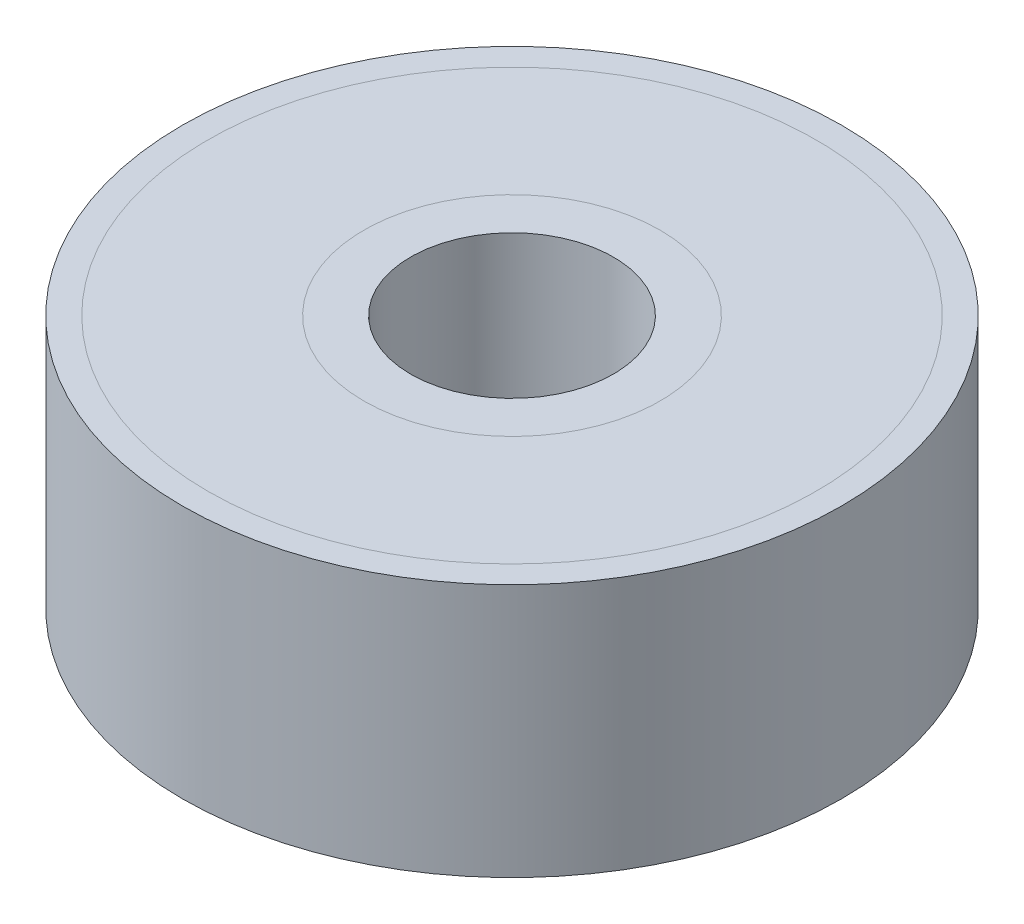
ISO-10303-21;
HEADER;
FILE_DESCRIPTION(('STEP AP214'),'2;1');
FILE_NAME('part.step','',(''),(''),'','','');
FILE_SCHEMA(('AUTOMOTIVE_DESIGN { 1 0 10303 214 1 1 1 1 }'));
ENDSEC;
DATA;
#1=APPLICATION_CONTEXT('core data for automotive mechanical design processes');
#2=APPLICATION_PROTOCOL_DEFINITION('international standard','automotive_design',2000,#1);
#3=PRODUCT_CONTEXT('',#1,'mechanical');
#4=PRODUCT('Part','Part','',(#3));
#5=PRODUCT_RELATED_PRODUCT_CATEGORY('part','',(#4));
#6=PRODUCT_DEFINITION_FORMATION('','',#4);
#7=PRODUCT_DEFINITION_CONTEXT('part definition',#1,'design');
#8=PRODUCT_DEFINITION('design','',#6,#7);
#9=PRODUCT_DEFINITION_SHAPE('','',#8);
#10=(LENGTH_UNIT() NAMED_UNIT(*) SI_UNIT(.MILLI.,.METRE.));
#11=(NAMED_UNIT(*) PLANE_ANGLE_UNIT() SI_UNIT($,.RADIAN.));
#12=(NAMED_UNIT(*) SI_UNIT($,.STERADIAN.) SOLID_ANGLE_UNIT());
#13=UNCERTAINTY_MEASURE_WITH_UNIT(LENGTH_MEASURE(1.E-05),#10,'distance_accuracy_value','');
#14=(GEOMETRIC_REPRESENTATION_CONTEXT(3) GLOBAL_UNCERTAINTY_ASSIGNED_CONTEXT((#13)) GLOBAL_UNIT_ASSIGNED_CONTEXT((#10,
#11,#12)) REPRESENTATION_CONTEXT('',''));
#15=CARTESIAN_POINT('',(0.,0.,0.));
#16=DIRECTION('',(0.,0.,1.));
#17=DIRECTION('',(1.,0.,0.));
#18=AXIS2_PLACEMENT_3D('',#15,#16,#17);
#19=CARTESIAN_POINT('',(0.,-0.00999999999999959,0.));
#20=DIRECTION('',(0.,1.,0.));
#21=DIRECTION('',(0.,0.,1.));
#22=AXIS2_PLACEMENT_3D('',#19,#20,#21);
#23=CYLINDRICAL_SURFACE('',#22,2.91932716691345);
#24=CARTESIAN_POINT('',(0.,0.,0.));
#25=DIRECTION('',(0.,1.,0.));
#26=DIRECTION('',(0.,0.,1.));
#27=AXIS2_PLACEMENT_3D('',#24,#25,#26);
#28=CIRCLE('',#27,2.91932716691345);
#29=CARTESIAN_POINT('',(0.,0.,2.91932716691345));
#30=VERTEX_POINT('',#29);
#31=EDGE_CURVE('E71',#30,#30,#28,.T.);
#32=ORIENTED_EDGE('',*,*,#31,.T.);
#33=EDGE_LOOP('',(#32));
#34=FACE_BOUND('',#33,.T.);
#35=CARTESIAN_POINT('',(0.,5.,0.));
#36=DIRECTION('',(0.,1.,0.));
#37=DIRECTION('',(0.,0.,1.));
#38=AXIS2_PLACEMENT_3D('',#35,#36,#37);
#39=CIRCLE('',#38,2.91932716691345);
#40=CARTESIAN_POINT('',(0.,5.,2.91932716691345));
#41=VERTEX_POINT('',#40);
#42=EDGE_CURVE('E61',#41,#41,#39,.T.);
#43=ORIENTED_EDGE('',*,*,#42,.F.);
#44=EDGE_LOOP('',(#43));
#45=FACE_BOUND('',#44,.T.);
#46=ADVANCED_FACE('F57',(#34,#45),#23,.T.);
#47=CARTESIAN_POINT('',(0.,5.,0.));
#48=DIRECTION('',(0.,-1.,0.));
#49=DIRECTION('',(0.,0.,-1.));
#50=AXIS2_PLACEMENT_3D('',#47,#48,#49);
#51=CYLINDRICAL_SURFACE('',#50,2.);
#52=CARTESIAN_POINT('',(0.,5.,0.));
#53=DIRECTION('',(0.,1.,0.));
#54=DIRECTION('',(0.,0.,1.));
#55=AXIS2_PLACEMENT_3D('',#52,#53,#54);
#56=CIRCLE('',#55,2.);
#57=CARTESIAN_POINT('',(0.,5.,2.));
#58=VERTEX_POINT('',#57);
#59=EDGE_CURVE('E65',#58,#58,#56,.T.);
#60=ORIENTED_EDGE('',*,*,#59,.T.);
#61=EDGE_LOOP('',(#60));
#62=FACE_BOUND('',#61,.T.);
#63=CARTESIAN_POINT('',(0.,0.,0.));
#64=DIRECTION('',(0.,1.,0.));
#65=DIRECTION('',(0.,0.,1.));
#66=AXIS2_PLACEMENT_3D('',#63,#64,#65);
#67=CIRCLE('',#66,2.);
#68=CARTESIAN_POINT('',(0.,0.,2.));
#69=VERTEX_POINT('',#68);
#70=EDGE_CURVE('E13',#69,#69,#67,.T.);
#71=ORIENTED_EDGE('',*,*,#70,.F.);
#72=EDGE_LOOP('',(#71));
#73=FACE_BOUND('',#72,.T.);
#74=ADVANCED_FACE('F80',(#62,#73),#51,.F.);
#75=CARTESIAN_POINT('',(0.,0.,0.));
#76=DIRECTION('',(0.,1.,0.));
#77=DIRECTION('',(0.,0.,1.));
#78=AXIS2_PLACEMENT_3D('',#75,#76,#77);
#79=PLANE('',#78);
#80=ORIENTED_EDGE('',*,*,#70,.T.);
#81=EDGE_LOOP('',(#80));
#82=FACE_BOUND('',#81,.T.);
#83=ORIENTED_EDGE('',*,*,#31,.F.);
#84=EDGE_LOOP('',(#83));
#85=FACE_BOUND('',#84,.T.);
#86=ADVANCED_FACE('F85',(#82,#85),#79,.F.);
#87=CARTESIAN_POINT('',(0.,5.,0.));
#88=DIRECTION('',(0.,1.,0.));
#89=DIRECTION('',(0.,0.,1.));
#90=AXIS2_PLACEMENT_3D('',#87,#88,#89);
#91=PLANE('',#90);
#92=ORIENTED_EDGE('',*,*,#59,.F.);
#93=EDGE_LOOP('',(#92));
#94=FACE_BOUND('',#93,.T.);
#95=ORIENTED_EDGE('',*,*,#42,.T.);
#96=EDGE_LOOP('',(#95));
#97=FACE_BOUND('',#96,.T.);
#98=ADVANCED_FACE('F59',(#94,#97),#91,.T.);
#99=CLOSED_SHELL('',(#46,#74,#86,#98));
#100=MANIFOLD_SOLID_BREP('B2',#99);
#101=CARTESIAN_POINT('',(0.,-0.00999999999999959,0.));
#102=DIRECTION('',(0.,1.,0.));
#103=DIRECTION('',(0.,0.,1.));
#104=AXIS2_PLACEMENT_3D('',#101,#102,#103);
#105=CYLINDRICAL_SURFACE('',#104,5.99786796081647);
#106=CARTESIAN_POINT('',(0.,5.,0.));
#107=DIRECTION('',(0.,1.,0.));
#108=DIRECTION('',(0.,0.,1.));
#109=AXIS2_PLACEMENT_3D('',#106,#107,#108);
#110=CIRCLE('',#109,5.99786796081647);
#111=CARTESIAN_POINT('',(0.,5.,5.99786796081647));
#112=VERTEX_POINT('',#111);
#113=EDGE_CURVE('E56',#112,#112,#110,.T.);
#114=ORIENTED_EDGE('',*,*,#113,.T.);
#115=EDGE_LOOP('',(#114));
#116=FACE_BOUND('',#115,.T.);
#117=CARTESIAN_POINT('',(0.,0.,0.));
#118=DIRECTION('',(0.,1.,0.));
#119=DIRECTION('',(0.,0.,1.));
#120=AXIS2_PLACEMENT_3D('',#117,#118,#119);
#121=CIRCLE('',#120,5.99786796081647);
#122=CARTESIAN_POINT('',(0.,0.,5.99786796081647));
#123=VERTEX_POINT('',#122);
#124=EDGE_CURVE('E145',#123,#123,#121,.T.);
#125=ORIENTED_EDGE('',*,*,#124,.F.);
#126=EDGE_LOOP('',(#125));
#127=FACE_BOUND('',#126,.T.);
#128=ADVANCED_FACE('F139',(#116,#127),#105,.F.);
#129=CARTESIAN_POINT('',(0.,5.,0.));
#130=DIRECTION('',(0.,-1.,0.));
#131=DIRECTION('',(0.,0.,-1.));
#132=AXIS2_PLACEMENT_3D('',#129,#130,#131);
#133=CYLINDRICAL_SURFACE('',#132,6.5);
#134=CARTESIAN_POINT('',(0.,5.,0.));
#135=DIRECTION('',(0.,1.,0.));
#136=DIRECTION('',(0.,0.,1.));
#137=AXIS2_PLACEMENT_3D('',#134,#135,#136);
#138=CIRCLE('',#137,6.5);
#139=CARTESIAN_POINT('',(0.,5.,6.5));
#140=VERTEX_POINT('',#139);
#141=EDGE_CURVE('E149',#140,#140,#138,.T.);
#142=ORIENTED_EDGE('',*,*,#141,.F.);
#143=EDGE_LOOP('',(#142));
#144=FACE_BOUND('',#143,.T.);
#145=CARTESIAN_POINT('',(0.,0.,0.));
#146=DIRECTION('',(0.,1.,0.));
#147=DIRECTION('',(0.,0.,1.));
#148=AXIS2_PLACEMENT_3D('',#145,#146,#147);
#149=CIRCLE('',#148,6.5);
#150=CARTESIAN_POINT('',(0.,0.,6.5));
#151=VERTEX_POINT('',#150);
#152=EDGE_CURVE('E153',#151,#151,#149,.T.);
#153=ORIENTED_EDGE('',*,*,#152,.T.);
#154=EDGE_LOOP('',(#153));
#155=FACE_BOUND('',#154,.T.);
#156=ADVANCED_FACE('F159',(#144,#155),#133,.T.);
#157=CARTESIAN_POINT('',(0.,0.,0.));
#158=DIRECTION('',(0.,1.,0.));
#159=DIRECTION('',(0.,0.,1.));
#160=AXIS2_PLACEMENT_3D('',#157,#158,#159);
#161=PLANE('',#160);
#162=ORIENTED_EDGE('',*,*,#124,.T.);
#163=EDGE_LOOP('',(#162));
#164=FACE_BOUND('',#163,.T.);
#165=ORIENTED_EDGE('',*,*,#152,.F.);
#166=EDGE_LOOP('',(#165));
#167=FACE_BOUND('',#166,.T.);
#168=ADVANCED_FACE('F161',(#164,#167),#161,.F.);
#169=CARTESIAN_POINT('',(0.,5.,0.));
#170=DIRECTION('',(0.,1.,0.));
#171=DIRECTION('',(0.,0.,1.));
#172=AXIS2_PLACEMENT_3D('',#169,#170,#171);
#173=PLANE('',#172);
#174=ORIENTED_EDGE('',*,*,#113,.F.);
#175=EDGE_LOOP('',(#174));
#176=FACE_BOUND('',#175,.T.);
#177=ORIENTED_EDGE('',*,*,#141,.T.);
#178=EDGE_LOOP('',(#177));
#179=FACE_BOUND('',#178,.T.);
#180=ADVANCED_FACE('F163',(#176,#179),#173,.T.);
#181=CLOSED_SHELL('',(#128,#156,#168,#180));
#182=MANIFOLD_SOLID_BREP('B8',#181);
#183=CARTESIAN_POINT('',(0.,-0.00999999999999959,0.));
#184=DIRECTION('',(0.,1.,0.));
#185=DIRECTION('',(0.,0.,1.));
#186=AXIS2_PLACEMENT_3D('',#183,#184,#185);
#187=CYLINDRICAL_SURFACE('',#186,2.91932716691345);
#188=CARTESIAN_POINT('',(0.,5.,0.));
#189=DIRECTION('',(0.,1.,0.));
#190=DIRECTION('',(0.,0.,1.));
#191=AXIS2_PLACEMENT_3D('',#188,#189,#190);
#192=CIRCLE('',#191,2.91932716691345);
#193=CARTESIAN_POINT('',(0.,5.,2.91932716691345));
#194=VERTEX_POINT('',#193);
#195=EDGE_CURVE('E216',#194,#194,#192,.T.);
#196=ORIENTED_EDGE('',*,*,#195,.T.);
#197=EDGE_LOOP('',(#196));
#198=FACE_BOUND('',#197,.T.);
#199=CARTESIAN_POINT('',(0.,0.,0.));
#200=DIRECTION('',(0.,1.,0.));
#201=DIRECTION('',(0.,0.,1.));
#202=AXIS2_PLACEMENT_3D('',#199,#200,#201);
#203=CIRCLE('',#202,2.91932716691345);
#204=CARTESIAN_POINT('',(0.,0.,2.91932716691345));
#205=VERTEX_POINT('',#204);
#206=EDGE_CURVE('E138',#205,#205,#203,.T.);
#207=ORIENTED_EDGE('',*,*,#206,.F.);
#208=EDGE_LOOP('',(#207));
#209=FACE_BOUND('',#208,.T.);
#210=ADVANCED_FACE('F212',(#198,#209),#187,.F.);
#211=CARTESIAN_POINT('',(0.,-0.00999999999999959,0.));
#212=DIRECTION('',(0.,1.,0.));
#213=DIRECTION('',(0.,0.,1.));
#214=AXIS2_PLACEMENT_3D('',#211,#212,#213);
#215=CYLINDRICAL_SURFACE('',#214,5.99786796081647);
#216=CARTESIAN_POINT('',(0.,0.,0.));
#217=DIRECTION('',(0.,1.,0.));
#218=DIRECTION('',(0.,0.,1.));
#219=AXIS2_PLACEMENT_3D('',#216,#217,#218);
#220=CIRCLE('',#219,5.99786796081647);
#221=CARTESIAN_POINT('',(0.,0.,5.99786796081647));
#222=VERTEX_POINT('',#221);
#223=EDGE_CURVE('E226',#222,#222,#220,.T.);
#224=ORIENTED_EDGE('',*,*,#223,.T.);
#225=EDGE_LOOP('',(#224));
#226=FACE_BOUND('',#225,.T.);
#227=CARTESIAN_POINT('',(0.,5.,0.));
#228=DIRECTION('',(0.,1.,0.));
#229=DIRECTION('',(0.,0.,1.));
#230=AXIS2_PLACEMENT_3D('',#227,#228,#229);
#231=CIRCLE('',#230,5.99786796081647);
#232=CARTESIAN_POINT('',(0.,5.,5.99786796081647));
#233=VERTEX_POINT('',#232);
#234=EDGE_CURVE('E220',#233,#233,#231,.T.);
#235=ORIENTED_EDGE('',*,*,#234,.F.);
#236=EDGE_LOOP('',(#235));
#237=FACE_BOUND('',#236,.T.);
#238=ADVANCED_FACE('F238',(#226,#237),#215,.T.);
#239=CARTESIAN_POINT('',(0.,0.,0.));
#240=DIRECTION('',(0.,1.,0.));
#241=DIRECTION('',(0.,0.,1.));
#242=AXIS2_PLACEMENT_3D('',#239,#240,#241);
#243=PLANE('',#242);
#244=ORIENTED_EDGE('',*,*,#206,.T.);
#245=EDGE_LOOP('',(#244));
#246=FACE_BOUND('',#245,.T.);
#247=ORIENTED_EDGE('',*,*,#223,.F.);
#248=EDGE_LOOP('',(#247));
#249=FACE_BOUND('',#248,.T.);
#250=ADVANCED_FACE('F237',(#246,#249),#243,.F.);
#251=CARTESIAN_POINT('',(0.,5.,0.));
#252=DIRECTION('',(0.,1.,0.));
#253=DIRECTION('',(0.,0.,1.));
#254=AXIS2_PLACEMENT_3D('',#251,#252,#253);
#255=PLANE('',#254);
#256=ORIENTED_EDGE('',*,*,#195,.F.);
#257=EDGE_LOOP('',(#256));
#258=FACE_BOUND('',#257,.T.);
#259=ORIENTED_EDGE('',*,*,#234,.T.);
#260=EDGE_LOOP('',(#259));
#261=FACE_BOUND('',#260,.T.);
#262=ADVANCED_FACE('F214',(#258,#261),#255,.T.);
#263=CLOSED_SHELL('',(#210,#238,#250,#262));
#264=MANIFOLD_SOLID_BREP('B51',#263);
#265=ADVANCED_BREP_SHAPE_REPRESENTATION('',(#18,#100,#182,#264),#14);
#266=SHAPE_DEFINITION_REPRESENTATION(#9,#265);
ENDSEC;
END-ISO-10303-21;
